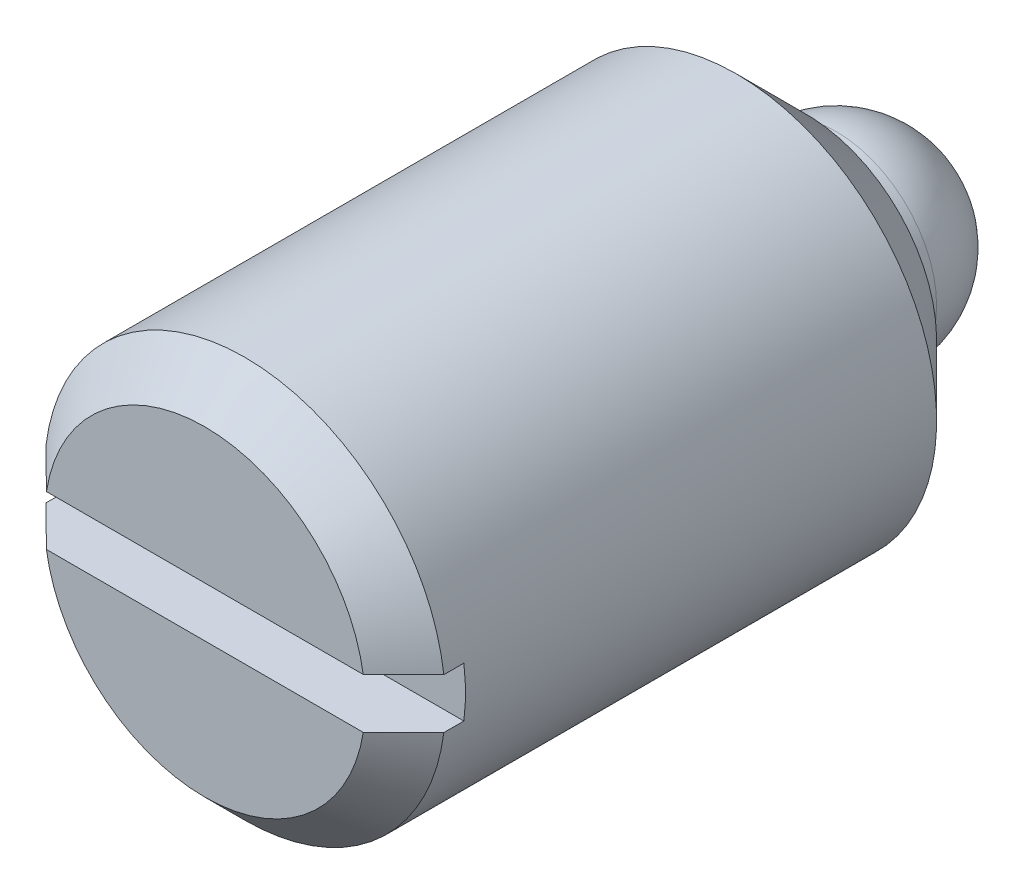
ISO-10303-21;
HEADER;
FILE_DESCRIPTION(('STEP AP214'),'2;1');
FILE_NAME('part.step','',(''),(''),'','','');
FILE_SCHEMA(('AUTOMOTIVE_DESIGN { 1 0 10303 214 1 1 1 1 }'));
ENDSEC;
DATA;
#1=APPLICATION_CONTEXT('core data for automotive mechanical design processes');
#2=APPLICATION_PROTOCOL_DEFINITION('international standard','automotive_design',2000,#1);
#3=PRODUCT_CONTEXT('',#1,'mechanical');
#4=PRODUCT('Part','Part','',(#3));
#5=PRODUCT_RELATED_PRODUCT_CATEGORY('part','',(#4));
#6=PRODUCT_DEFINITION_FORMATION('','',#4);
#7=PRODUCT_DEFINITION_CONTEXT('part definition',#1,'design');
#8=PRODUCT_DEFINITION('design','',#6,#7);
#9=PRODUCT_DEFINITION_SHAPE('','',#8);
#10=(LENGTH_UNIT() NAMED_UNIT(*) SI_UNIT(.MILLI.,.METRE.));
#11=(NAMED_UNIT(*) PLANE_ANGLE_UNIT() SI_UNIT($,.RADIAN.));
#12=(NAMED_UNIT(*) SI_UNIT($,.STERADIAN.) SOLID_ANGLE_UNIT());
#13=UNCERTAINTY_MEASURE_WITH_UNIT(LENGTH_MEASURE(1.E-05),#10,'distance_accuracy_value','');
#14=(GEOMETRIC_REPRESENTATION_CONTEXT(3) GLOBAL_UNCERTAINTY_ASSIGNED_CONTEXT((#13)) GLOBAL_UNIT_ASSIGNED_CONTEXT((#10,
#11,#12)) REPRESENTATION_CONTEXT('',''));
#15=CARTESIAN_POINT('',(0.,0.,0.));
#16=DIRECTION('',(0.,0.,1.));
#17=DIRECTION('',(1.,0.,0.));
#18=AXIS2_PLACEMENT_3D('',#15,#16,#17);
#19=CARTESIAN_POINT('',(0.,-10.,36.5));
#20=DIRECTION('',(0.,0.,1.));
#21=DIRECTION('',(-1.,0.,0.));
#22=AXIS2_PLACEMENT_3D('',#19,#20,#21);
#23=PLANE('',#22);
#24=DIRECTION('',(-1.,0.,0.));
#25=VECTOR('',#24,1.);
#26=CARTESIAN_POINT('',(9.92156741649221,-1.25,36.5));
#27=LINE('',#26,#25);
#28=CARTESIAN_POINT('',(7.90174031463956,-1.25,36.5));
#29=VERTEX_POINT('',#28);
#30=CARTESIAN_POINT('',(-7.90174031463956,-1.25,36.5));
#31=VERTEX_POINT('',#30);
#32=EDGE_CURVE('E77',#29,#31,#27,.T.);
#33=ORIENTED_EDGE('',*,*,#32,.T.);
#34=CARTESIAN_POINT('',(0.,0.,36.5));
#35=DIRECTION('',(0.,0.,1.));
#36=DIRECTION('',(0.,1.,0.));
#37=AXIS2_PLACEMENT_3D('',#34,#35,#36);
#38=CIRCLE('',#37,8.);
#39=EDGE_CURVE('E272',#31,#29,#38,.T.);
#40=ORIENTED_EDGE('',*,*,#39,.T.);
#41=EDGE_LOOP('',(#33,#40));
#42=FACE_BOUND('',#41,.T.);
#43=ADVANCED_FACE('F14',(#42),#23,.T.);
#44=CARTESIAN_POINT('',(0.,0.,-3.5));
#45=DIRECTION('',(0.,0.,-1.));
#46=DIRECTION('',(1.,0.,0.));
#47=AXIS2_PLACEMENT_3D('',#44,#45,#46);
#48=CYLINDRICAL_SURFACE('',#47,10.);
#49=CARTESIAN_POINT('',(0.,0.,10.));
#50=DIRECTION('',(0.,0.,-1.));
#51=DIRECTION('',(0.,-1.,0.));
#52=AXIS2_PLACEMENT_3D('',#49,#50,#51);
#53=CIRCLE('',#52,10.);
#54=CARTESIAN_POINT('',(0.,-10.,10.));
#55=VERTEX_POINT('',#54);
#56=EDGE_CURVE('E9',#55,#55,#53,.F.);
#57=ORIENTED_EDGE('',*,*,#56,.T.);
#58=EDGE_LOOP('',(#57));
#59=FACE_BOUND('',#58,.T.);
#60=DIRECTION('',(0.,0.,1.));
#61=VECTOR('',#60,1.);
#62=CARTESIAN_POINT('',(9.92156741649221,-1.25,34.5));
#63=LINE('',#62,#61);
#64=CARTESIAN_POINT('',(9.92156741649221,-1.25,33.5));
#65=VERTEX_POINT('',#64);
#66=CARTESIAN_POINT('',(9.92156741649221,-1.25,34.5));
#67=VERTEX_POINT('',#66);
#68=EDGE_CURVE('E103',#65,#67,#63,.T.);
#69=ORIENTED_EDGE('',*,*,#68,.T.);
#70=CARTESIAN_POINT('',(0.,0.,34.5));
#71=DIRECTION('',(0.,0.,1.));
#72=DIRECTION('',(0.,1.,0.));
#73=AXIS2_PLACEMENT_3D('',#70,#71,#72);
#74=CIRCLE('',#73,10.);
#75=CARTESIAN_POINT('',(-9.92156741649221,-1.25,34.5));
#76=VERTEX_POINT('',#75);
#77=EDGE_CURVE('E112',#67,#76,#74,.F.);
#78=ORIENTED_EDGE('',*,*,#77,.T.);
#79=DIRECTION('',(0.,0.,1.));
#80=VECTOR('',#79,1.);
#81=CARTESIAN_POINT('',(-9.92156741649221,-1.25,34.5));
#82=LINE('',#81,#80);
#83=CARTESIAN_POINT('',(-9.92156741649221,-1.25,33.5));
#84=VERTEX_POINT('',#83);
#85=EDGE_CURVE('E100',#84,#76,#82,.T.);
#86=ORIENTED_EDGE('',*,*,#85,.F.);
#87=CARTESIAN_POINT('',(0.,0.,33.5));
#88=DIRECTION('',(0.,0.,1.));
#89=DIRECTION('',(0.,1.,0.));
#90=AXIS2_PLACEMENT_3D('',#87,#88,#89);
#91=CIRCLE('',#90,10.);
#92=CARTESIAN_POINT('',(-9.92156741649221,1.25,33.5));
#93=VERTEX_POINT('',#92);
#94=EDGE_CURVE('E85',#93,#84,#91,.T.);
#95=ORIENTED_EDGE('',*,*,#94,.F.);
#96=DIRECTION('',(0.,0.,1.));
#97=VECTOR('',#96,1.);
#98=CARTESIAN_POINT('',(-9.92156741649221,1.25,34.5));
#99=LINE('',#98,#97);
#100=CARTESIAN_POINT('',(-9.92156741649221,1.25,34.5));
#101=VERTEX_POINT('',#100);
#102=EDGE_CURVE('E76',#93,#101,#99,.T.);
#103=ORIENTED_EDGE('',*,*,#102,.T.);
#104=CARTESIAN_POINT('',(0.,0.,34.5));
#105=DIRECTION('',(0.,0.,1.));
#106=DIRECTION('',(0.,1.,0.));
#107=AXIS2_PLACEMENT_3D('',#104,#105,#106);
#108=CIRCLE('',#107,10.);
#109=CARTESIAN_POINT('',(9.92156741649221,1.25,34.5));
#110=VERTEX_POINT('',#109);
#111=EDGE_CURVE('E75',#101,#110,#108,.F.);
#112=ORIENTED_EDGE('',*,*,#111,.T.);
#113=DIRECTION('',(0.,0.,1.));
#114=VECTOR('',#113,1.);
#115=CARTESIAN_POINT('',(9.92156741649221,1.25,34.5));
#116=LINE('',#115,#114);
#117=CARTESIAN_POINT('',(9.92156741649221,1.25,33.5));
#118=VERTEX_POINT('',#117);
#119=EDGE_CURVE('E67',#118,#110,#116,.T.);
#120=ORIENTED_EDGE('',*,*,#119,.F.);
#121=CARTESIAN_POINT('',(0.,0.,33.5));
#122=DIRECTION('',(0.,0.,1.));
#123=DIRECTION('',(0.,1.,0.));
#124=AXIS2_PLACEMENT_3D('',#121,#122,#123);
#125=CIRCLE('',#124,10.);
#126=EDGE_CURVE('E72',#65,#118,#125,.T.);
#127=ORIENTED_EDGE('',*,*,#126,.F.);
#128=EDGE_LOOP('',(#69,#78,#86,#95,#103,#112,#120,#127));
#129=FACE_BOUND('',#128,.T.);
#130=ADVANCED_FACE('F70',(#59,#129),#48,.T.);
#131=CARTESIAN_POINT('',(0.,-5.,6.5));
#132=DIRECTION('',(0.,0.,-1.));
#133=DIRECTION('',(1.,0.,0.));
#134=AXIS2_PLACEMENT_3D('',#131,#132,#133);
#135=PLANE('',#134);
#136=CARTESIAN_POINT('',(0.,0.,6.5));
#137=DIRECTION('',(0.,0.,-1.));
#138=DIRECTION('',(0.,-1.,0.));
#139=AXIS2_PLACEMENT_3D('',#136,#137,#138);
#140=CIRCLE('',#139,6.5);
#141=CARTESIAN_POINT('',(0.,-6.5,6.5));
#142=VERTEX_POINT('',#141);
#143=EDGE_CURVE('E22',#142,#142,#140,.T.);
#144=ORIENTED_EDGE('',*,*,#143,.T.);
#145=EDGE_LOOP('',(#144));
#146=FACE_BOUND('',#145,.T.);
#147=CARTESIAN_POINT('',(0.,0.,6.5));
#148=DIRECTION('',(0.,0.,-1.));
#149=DIRECTION('',(1.,0.,0.));
#150=AXIS2_PLACEMENT_3D('',#147,#148,#149);
#151=CIRCLE('',#150,5.);
#152=CARTESIAN_POINT('',(5.,0.,6.5));
#153=VERTEX_POINT('',#152);
#154=EDGE_CURVE('E108',#153,#153,#151,.T.);
#155=ORIENTED_EDGE('',*,*,#154,.F.);
#156=EDGE_LOOP('',(#155));
#157=FACE_BOUND('',#156,.T.);
#158=ADVANCED_FACE('F139',(#146,#157),#135,.T.);
#159=CARTESIAN_POINT('',(0.,0.,-3.5));
#160=DIRECTION('',(0.,0.,-1.));
#161=DIRECTION('',(1.,0.,0.));
#162=AXIS2_PLACEMENT_3D('',#159,#160,#161);
#163=CYLINDRICAL_SURFACE('',#162,5.);
#164=CARTESIAN_POINT('',(0.,0.,5.));
#165=DIRECTION('',(0.,0.,-1.));
#166=DIRECTION('',(1.,0.,0.));
#167=AXIS2_PLACEMENT_3D('',#164,#165,#166);
#168=CIRCLE('',#167,5.);
#169=CARTESIAN_POINT('',(5.,0.,5.));
#170=VERTEX_POINT('',#169);
#171=EDGE_CURVE('E105',#170,#170,#168,.T.);
#172=ORIENTED_EDGE('',*,*,#171,.F.);
#173=EDGE_LOOP('',(#172));
#174=FACE_BOUND('',#173,.T.);
#175=ORIENTED_EDGE('',*,*,#154,.T.);
#176=EDGE_LOOP('',(#175));
#177=FACE_BOUND('',#176,.T.);
#178=ADVANCED_FACE('F182',(#174,#177),#163,.T.);
#179=CARTESIAN_POINT('',(0.,0.,5.));
#180=DIRECTION('',(1.,0.,0.));
#181=DIRECTION('',(0.,0.,1.));
#182=AXIS2_PLACEMENT_3D('',#179,#180,#181);
#183=SPHERICAL_SURFACE('',#182,5.);
#184=CARTESIAN_POINT('',(0.,0.,5.));
#185=DIRECTION('',(0.,0.,-1.));
#186=DIRECTION('',(1.,0.,0.));
#187=AXIS2_PLACEMENT_3D('',#184,#185,#186);
#188=SPHERICAL_SURFACE('',#187,5.);
#189=ORIENTED_EDGE('',*,*,#171,.T.);
#190=EDGE_LOOP('',(#189));
#191=FACE_BOUND('',#190,.T.);
#192=ADVANCED_FACE('F176',(#191),#188,.T.);
#193=DIRECTION('',(-1.,0.,0.));
#194=VECTOR('',#193,1.);
#195=CARTESIAN_POINT('',(9.92156741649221,1.25,36.5));
#196=LINE('',#195,#194);
#197=CARTESIAN_POINT('',(7.90174031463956,1.25,36.5));
#198=VERTEX_POINT('',#197);
#199=CARTESIAN_POINT('',(-7.90174031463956,1.25,36.5));
#200=VERTEX_POINT('',#199);
#201=EDGE_CURVE('E95',#198,#200,#196,.T.);
#202=ORIENTED_EDGE('',*,*,#201,.F.);
#203=CARTESIAN_POINT('',(0.,0.,36.5));
#204=DIRECTION('',(0.,0.,1.));
#205=DIRECTION('',(0.,1.,0.));
#206=AXIS2_PLACEMENT_3D('',#203,#204,#205);
#207=CIRCLE('',#206,8.);
#208=EDGE_CURVE('E28',#198,#200,#207,.T.);
#209=ORIENTED_EDGE('',*,*,#208,.T.);
#210=EDGE_LOOP('',(#202,#209));
#211=FACE_BOUND('',#210,.T.);
#212=ADVANCED_FACE('F169',(#211),#23,.T.);
#213=CARTESIAN_POINT('',(9.92156741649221,-1.25,34.5));
#214=DIRECTION('',(0.,1.,0.));
#215=DIRECTION('',(-1.,0.,0.));
#216=AXIS2_PLACEMENT_3D('',#213,#214,#215);
#217=PLANE('',#216);
#218=ORIENTED_EDGE('',*,*,#85,.T.);
#219=CARTESIAN_POINT('',(-9.92156741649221,-1.25,34.5));
#220=CARTESIAN_POINT('',(-9.75341399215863,-1.25,34.6668337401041));
#221=CARTESIAN_POINT('',(-9.58522823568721,-1.25,34.8336349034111));
#222=CARTESIAN_POINT('',(-9.2487791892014,-1.25,35.1671589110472));
#223=CARTESIAN_POINT('',(-9.08051589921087,-1.25,35.3338817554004));
#224=CARTESIAN_POINT('',(-8.74389879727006,-1.25,35.6672360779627));
#225=CARTESIAN_POINT('',(-8.57554498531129,-1.25,35.8338675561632));
#226=CARTESIAN_POINT('',(-8.23872867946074,-1.25,36.1670207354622));
#227=CARTESIAN_POINT('',(-8.07026618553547,-1.25,36.3335424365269));
#228=CARTESIAN_POINT('',(-7.90174031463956,-1.25,36.5));
#229=B_SPLINE_CURVE_WITH_KNOTS('',3,(#219,#220,#221,#222,#223,#224,#225,#226,#227,#228),
.UNSPECIFIED.,.F.,.F.,(4,2,2,2,4),(0.,0.710620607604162,1.42124099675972,2.1318614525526,
2.84248212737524),.UNSPECIFIED.);
#230=EDGE_CURVE('E123',#76,#31,#229,.T.);
#231=ORIENTED_EDGE('',*,*,#230,.T.);
#232=ORIENTED_EDGE('',*,*,#32,.F.);
#233=CARTESIAN_POINT('',(7.90174031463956,-1.25,36.5));
#234=CARTESIAN_POINT('',(8.07026618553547,-1.25,36.3335424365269));
#235=CARTESIAN_POINT('',(8.23872867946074,-1.25,36.1670207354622));
#236=CARTESIAN_POINT('',(8.57554498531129,-1.25,35.8338675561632));
#237=CARTESIAN_POINT('',(8.74389879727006,-1.25,35.6672360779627));
#238=CARTESIAN_POINT('',(9.08051589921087,-1.25,35.3338817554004));
#239=CARTESIAN_POINT('',(9.2487791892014,-1.25,35.1671589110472));
#240=CARTESIAN_POINT('',(9.58522823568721,-1.25,34.8336349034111));
#241=CARTESIAN_POINT('',(9.75341399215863,-1.25,34.6668337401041));
#242=CARTESIAN_POINT('',(9.92156741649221,-1.25,34.5));
#243=B_SPLINE_CURVE_WITH_KNOTS('',3,(#233,#234,#235,#236,#237,#238,#239,#240,#241,#242),
.UNSPECIFIED.,.F.,.F.,(4,2,2,2,4),(0.,0.71062067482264,1.42124113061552,2.13186151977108,
2.84248212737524),.UNSPECIFIED.);
#244=EDGE_CURVE('E115',#29,#67,#243,.T.);
#245=ORIENTED_EDGE('',*,*,#244,.T.);
#246=ORIENTED_EDGE('',*,*,#68,.F.);
#247=DIRECTION('',(1.,0.,0.));
#248=VECTOR('',#247,1.);
#249=CARTESIAN_POINT('',(-9.92156741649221,-1.25,33.5));
#250=LINE('',#249,#248);
#251=EDGE_CURVE('E90',#84,#65,#250,.T.);
#252=ORIENTED_EDGE('',*,*,#251,.F.);
#253=EDGE_LOOP('',(#218,#231,#232,#245,#246,#252));
#254=FACE_BOUND('',#253,.T.);
#255=ADVANCED_FACE('F129',(#254),#217,.T.);
#256=CARTESIAN_POINT('',(9.92156741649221,1.25,34.5));
#257=DIRECTION('',(0.,1.,0.));
#258=DIRECTION('',(-1.,0.,0.));
#259=AXIS2_PLACEMENT_3D('',#256,#257,#258);
#260=PLANE('',#259);
#261=ORIENTED_EDGE('',*,*,#119,.T.);
#262=CARTESIAN_POINT('',(9.92156741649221,1.25,34.5));
#263=CARTESIAN_POINT('',(9.75341399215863,1.25,34.6668337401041));
#264=CARTESIAN_POINT('',(9.58522823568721,1.25,34.8336349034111));
#265=CARTESIAN_POINT('',(9.2487791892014,1.25,35.1671589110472));
#266=CARTESIAN_POINT('',(9.08051589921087,1.25,35.3338817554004));
#267=CARTESIAN_POINT('',(8.74389879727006,1.25,35.6672360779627));
#268=CARTESIAN_POINT('',(8.57554498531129,1.25,35.8338675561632));
#269=CARTESIAN_POINT('',(8.23872867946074,1.25,36.1670207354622));
#270=CARTESIAN_POINT('',(8.07026618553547,1.25,36.3335424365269));
#271=CARTESIAN_POINT('',(7.90174031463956,1.25,36.5));
#272=B_SPLINE_CURVE_WITH_KNOTS('',3,(#262,#263,#264,#265,#266,#267,#268,#269,#270,#271),
.UNSPECIFIED.,.F.,.F.,(4,2,2,2,4),(0.,0.710620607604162,1.42124099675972,2.1318614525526,
2.84248212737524),.UNSPECIFIED.);
#273=EDGE_CURVE('E35',#110,#198,#272,.T.);
#274=ORIENTED_EDGE('',*,*,#273,.T.);
#275=ORIENTED_EDGE('',*,*,#201,.T.);
#276=CARTESIAN_POINT('',(-7.90174031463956,1.25,36.5));
#277=CARTESIAN_POINT('',(-8.07026618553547,1.25,36.3335424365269));
#278=CARTESIAN_POINT('',(-8.23872867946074,1.25,36.1670207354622));
#279=CARTESIAN_POINT('',(-8.57554498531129,1.25,35.8338675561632));
#280=CARTESIAN_POINT('',(-8.74389879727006,1.25,35.6672360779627));
#281=CARTESIAN_POINT('',(-9.08051589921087,1.25,35.3338817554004));
#282=CARTESIAN_POINT('',(-9.2487791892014,1.25,35.1671589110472));
#283=CARTESIAN_POINT('',(-9.58522823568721,1.25,34.8336349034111));
#284=CARTESIAN_POINT('',(-9.75341399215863,1.25,34.6668337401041));
#285=CARTESIAN_POINT('',(-9.92156741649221,1.25,34.5));
#286=B_SPLINE_CURVE_WITH_KNOTS('',3,(#276,#277,#278,#279,#280,#281,#282,#283,#284,#285),
.UNSPECIFIED.,.F.,.F.,(4,2,2,2,4),(0.,0.71062067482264,1.42124113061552,2.13186151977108,
2.84248212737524),.UNSPECIFIED.);
#287=EDGE_CURVE('E147',#200,#101,#286,.T.);
#288=ORIENTED_EDGE('',*,*,#287,.T.);
#289=ORIENTED_EDGE('',*,*,#102,.F.);
#290=DIRECTION('',(-1.,0.,0.));
#291=VECTOR('',#290,1.);
#292=CARTESIAN_POINT('',(9.92156741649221,1.25,33.5));
#293=LINE('',#292,#291);
#294=EDGE_CURVE('E80',#118,#93,#293,.T.);
#295=ORIENTED_EDGE('',*,*,#294,.F.);
#296=EDGE_LOOP('',(#261,#274,#275,#288,#289,#295));
#297=FACE_BOUND('',#296,.T.);
#298=ADVANCED_FACE('F81',(#297),#260,.F.);
#299=CARTESIAN_POINT('',(0.,0.,33.5));
#300=DIRECTION('',(0.,0.,1.));
#301=DIRECTION('',(0.,1.,0.));
#302=AXIS2_PLACEMENT_3D('',#299,#300,#301);
#303=PLANE('',#302);
#304=ORIENTED_EDGE('',*,*,#126,.T.);
#305=ORIENTED_EDGE('',*,*,#294,.T.);
#306=ORIENTED_EDGE('',*,*,#94,.T.);
#307=ORIENTED_EDGE('',*,*,#251,.T.);
#308=EDGE_LOOP('',(#304,#305,#306,#307));
#309=FACE_BOUND('',#308,.T.);
#310=ADVANCED_FACE('F88',(#309),#303,.T.);
#311=CARTESIAN_POINT('',(0.,0.,34.5));
#312=DIRECTION('',(0.,0.,-1.));
#313=DIRECTION('',(0.,-1.,0.));
#314=AXIS2_PLACEMENT_3D('',#311,#312,#313);
#315=CONICAL_SURFACE('',#314,10.,0.785398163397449);
#316=ORIENTED_EDGE('',*,*,#244,.F.);
#317=ORIENTED_EDGE('',*,*,#39,.F.);
#318=ORIENTED_EDGE('',*,*,#230,.F.);
#319=ORIENTED_EDGE('',*,*,#77,.F.);
#320=EDGE_LOOP('',(#316,#317,#318,#319));
#321=FACE_BOUND('',#320,.T.);
#322=ADVANCED_FACE('F133',(#321),#315,.T.);
#323=CARTESIAN_POINT('',(0.,0.,34.5));
#324=DIRECTION('',(0.,0.,-1.));
#325=DIRECTION('',(0.,-1.,0.));
#326=AXIS2_PLACEMENT_3D('',#323,#324,#325);
#327=CONICAL_SURFACE('',#326,10.,0.785398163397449);
#328=ORIENTED_EDGE('',*,*,#287,.F.);
#329=ORIENTED_EDGE('',*,*,#208,.F.);
#330=ORIENTED_EDGE('',*,*,#273,.F.);
#331=ORIENTED_EDGE('',*,*,#111,.F.);
#332=EDGE_LOOP('',(#328,#329,#330,#331));
#333=FACE_BOUND('',#332,.T.);
#334=ADVANCED_FACE('F137',(#333),#327,.T.);
#335=CARTESIAN_POINT('',(0.,0.,6.5));
#336=DIRECTION('',(0.,0.,1.));
#337=DIRECTION('',(0.,1.,0.));
#338=AXIS2_PLACEMENT_3D('',#335,#336,#337);
#339=CONICAL_SURFACE('',#338,6.5,0.785398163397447);
#340=ORIENTED_EDGE('',*,*,#56,.F.);
#341=EDGE_LOOP('',(#340));
#342=FACE_BOUND('',#341,.T.);
#343=ORIENTED_EDGE('',*,*,#143,.F.);
#344=EDGE_LOOP('',(#343));
#345=FACE_BOUND('',#344,.T.);
#346=ADVANCED_FACE('F16',(#342,#345),#339,.T.);
#347=CLOSED_SHELL('',(#43,#130,#158,#178,#192,#212,#255,#298,#310,#322,#334,#346));
#348=MANIFOLD_SOLID_BREP('B1',#347);
#349=ADVANCED_BREP_SHAPE_REPRESENTATION('',(#18,#348),#14);
#350=SHAPE_DEFINITION_REPRESENTATION(#9,#349);
ENDSEC;
END-ISO-10303-21;
